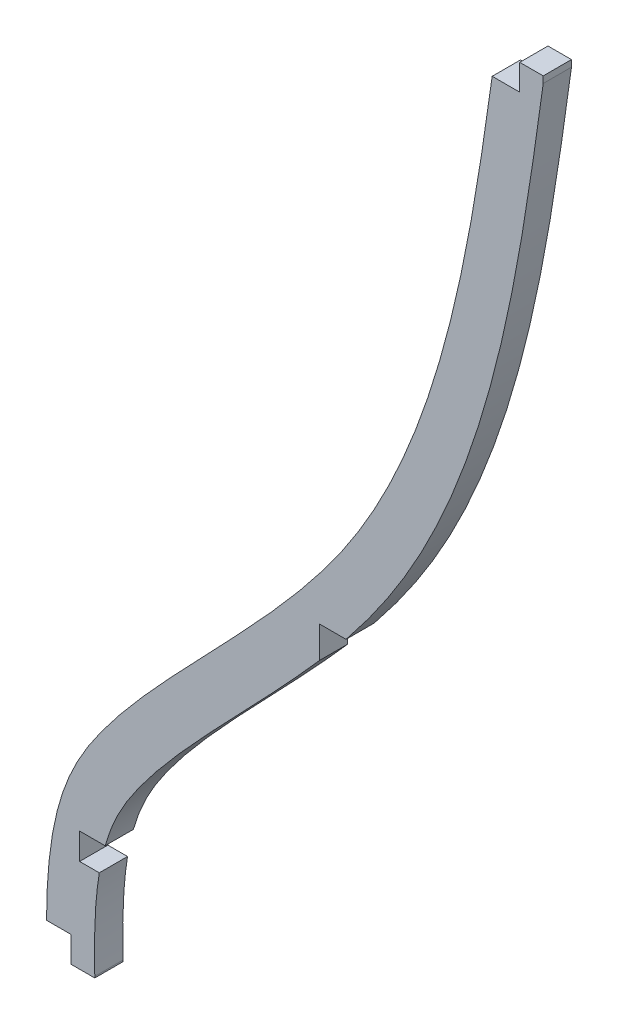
ISO-10303-21;
HEADER;
FILE_DESCRIPTION(('STEP AP214'),'2;1');
FILE_NAME('part.step','',(''),(''),'','','');
FILE_SCHEMA(('AUTOMOTIVE_DESIGN { 1 0 10303 214 1 1 1 1 }'));
ENDSEC;
DATA;
#1=APPLICATION_CONTEXT('core data for automotive mechanical design processes');
#2=APPLICATION_PROTOCOL_DEFINITION('international standard','automotive_design',2000,#1);
#3=PRODUCT_CONTEXT('',#1,'mechanical');
#4=PRODUCT('Part','Part','',(#3));
#5=PRODUCT_RELATED_PRODUCT_CATEGORY('part','',(#4));
#6=PRODUCT_DEFINITION_FORMATION('','',#4);
#7=PRODUCT_DEFINITION_CONTEXT('part definition',#1,'design');
#8=PRODUCT_DEFINITION('design','',#6,#7);
#9=PRODUCT_DEFINITION_SHAPE('','',#8);
#10=(LENGTH_UNIT() NAMED_UNIT(*) SI_UNIT(.MILLI.,.METRE.));
#11=(NAMED_UNIT(*) PLANE_ANGLE_UNIT() SI_UNIT($,.RADIAN.));
#12=(NAMED_UNIT(*) SI_UNIT($,.STERADIAN.) SOLID_ANGLE_UNIT());
#13=UNCERTAINTY_MEASURE_WITH_UNIT(LENGTH_MEASURE(1.E-05),#10,'distance_accuracy_value','');
#14=(GEOMETRIC_REPRESENTATION_CONTEXT(3) GLOBAL_UNCERTAINTY_ASSIGNED_CONTEXT((#13)) GLOBAL_UNIT_ASSIGNED_CONTEXT((#10,
#11,#12)) REPRESENTATION_CONTEXT('',''));
#15=CARTESIAN_POINT('',(0.,0.,0.));
#16=DIRECTION('',(0.,0.,1.));
#17=DIRECTION('',(1.,0.,0.));
#18=AXIS2_PLACEMENT_3D('',#15,#16,#17);
#19=CARTESIAN_POINT('',(-71.12228275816,0.152274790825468,2.9972));
#20=CARTESIAN_POINT('',(-71.1360709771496,0.612053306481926,2.9972));
#21=CARTESIAN_POINT('',(-71.1567058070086,1.54979316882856,2.9972));
#22=CARTESIAN_POINT('',(-71.1645984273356,3.28211812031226,2.9972));
#23=CARTESIAN_POINT('',(-71.1167972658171,5.2861742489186,2.9972));
#24=CARTESIAN_POINT('',(-70.9730711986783,7.42161548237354,2.9972));
#25=CARTESIAN_POINT('',(-70.6767068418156,9.95097976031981,2.9972));
#26=CARTESIAN_POINT('',(-70.1305550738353,12.5718264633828,2.9972));
#27=CARTESIAN_POINT('',(-69.2453812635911,15.104636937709,2.9972));
#28=CARTESIAN_POINT('',(-68.1202374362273,17.3343932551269,2.9972));
#29=CARTESIAN_POINT('',(-66.672184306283,19.5510756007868,2.9972));
#30=CARTESIAN_POINT('',(-64.8630643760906,21.9349302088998,2.9972));
#31=CARTESIAN_POINT('',(-62.1184326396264,25.2082421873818,2.9972));
#32=CARTESIAN_POINT('',(-58.1371910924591,29.5028468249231,2.9972));
#33=CARTESIAN_POINT('',(-52.8597313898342,34.9642275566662,2.9972));
#34=CARTESIAN_POINT('',(-47.4482093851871,40.7915416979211,2.9972));
#35=CARTESIAN_POINT('',(-42.2515146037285,47.0604507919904,2.9972));
#36=CARTESIAN_POINT('',(-37.6918324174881,53.925317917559,2.9972));
#37=CARTESIAN_POINT('',(-34.0642333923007,61.0843459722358,2.9972));
#38=CARTESIAN_POINT('',(-31.169794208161,68.4657942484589,2.9972));
#39=CARTESIAN_POINT('',(-28.9001236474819,75.9824768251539,2.9972));
#40=CARTESIAN_POINT('',(-27.1227122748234,83.5631378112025,2.9972));
#41=CARTESIAN_POINT('',(-25.7154204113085,91.1411224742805,2.9972));
#42=CARTESIAN_POINT('',(-24.7522109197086,97.3940158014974,2.9972));
#43=CARTESIAN_POINT('',(-24.0485885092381,102.335722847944,2.9972));
#44=CARTESIAN_POINT('',(-23.7122461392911,104.762949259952,2.9972));
#45=CARTESIAN_POINT('',(-23.5431598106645,105.98215738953,2.9972));
#46=B_SPLINE_CURVE_WITH_KNOTS('',3,(#19,#20,#21,#22,#23,#24,#25,#26,#27,#28,#29,#30,#31,#32,#33,
#34,#35,#36,#37,#38,#39,#40,#41,#42,#43,#44,#45),.UNSPECIFIED.,.F.,.F.,(4,1,1,1,1,1,1,1,1,1,1,1,
1,1,1,1,1,1,1,1,1,1,1,1,4),(0.,0.0078125,0.015625,0.03125,0.046875,0.0625,0.09375,0.125,0.15625,
0.1875,0.21875,0.25,0.3125,0.375,0.4375,0.5,0.5625,0.625,0.6875,0.75,0.8125,0.875,0.9375,
0.96875,1.),.UNSPECIFIED.);
#47=DIRECTION('',(0.,0.,-1.));
#48=VECTOR('',#47,1.);
#49=SURFACE_OF_LINEAR_EXTRUSION('',#46,#48);
#50=CARTESIAN_POINT('',(-71.12228275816,0.152274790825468,0.));
#51=CARTESIAN_POINT('',(-71.1360709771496,0.612053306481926,0.));
#52=CARTESIAN_POINT('',(-71.1567058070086,1.54979316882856,0.));
#53=CARTESIAN_POINT('',(-71.1645984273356,3.28211812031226,0.));
#54=CARTESIAN_POINT('',(-71.1167972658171,5.2861742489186,0.));
#55=CARTESIAN_POINT('',(-70.9730711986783,7.42161548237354,0.));
#56=CARTESIAN_POINT('',(-70.6767068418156,9.95097976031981,0.));
#57=CARTESIAN_POINT('',(-70.1305550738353,12.5718264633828,0.));
#58=CARTESIAN_POINT('',(-69.2453812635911,15.104636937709,0.));
#59=CARTESIAN_POINT('',(-68.1202374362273,17.3343932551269,0.));
#60=CARTESIAN_POINT('',(-66.672184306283,19.5510756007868,0.));
#61=CARTESIAN_POINT('',(-64.8630643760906,21.9349302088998,0.));
#62=CARTESIAN_POINT('',(-62.1184326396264,25.2082421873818,0.));
#63=CARTESIAN_POINT('',(-58.1371910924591,29.5028468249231,0.));
#64=CARTESIAN_POINT('',(-52.8597313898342,34.9642275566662,0.));
#65=CARTESIAN_POINT('',(-47.4482093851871,40.7915416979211,0.));
#66=CARTESIAN_POINT('',(-42.2515146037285,47.0604507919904,0.));
#67=CARTESIAN_POINT('',(-37.6918324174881,53.925317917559,0.));
#68=CARTESIAN_POINT('',(-34.0642333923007,61.0843459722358,0.));
#69=CARTESIAN_POINT('',(-31.169794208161,68.4657942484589,0.));
#70=CARTESIAN_POINT('',(-28.9001236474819,75.9824768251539,0.));
#71=CARTESIAN_POINT('',(-27.1227122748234,83.5631378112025,0.));
#72=CARTESIAN_POINT('',(-25.7154204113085,91.1411224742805,0.));
#73=CARTESIAN_POINT('',(-24.7522109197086,97.3940158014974,0.));
#74=CARTESIAN_POINT('',(-24.0485885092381,102.335722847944,0.));
#75=CARTESIAN_POINT('',(-23.7122461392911,104.762949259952,0.));
#76=CARTESIAN_POINT('',(-23.5431598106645,105.98215738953,0.));
#77=B_SPLINE_CURVE_WITH_KNOTS('',3,(#50,#51,#52,#53,#54,#55,#56,#57,#58,#59,#60,#61,#62,#63,#64,
#65,#66,#67,#68,#69,#70,#71,#72,#73,#74,#75,#76),.UNSPECIFIED.,.F.,.F.,(4,1,1,1,1,1,1,1,1,1,1,1,
1,1,1,1,1,1,1,1,1,1,1,1,4),(0.,0.0078125,0.015625,0.03125,0.046875,0.0625,0.09375,0.125,0.15625,
0.1875,0.21875,0.25,0.3125,0.375,0.4375,0.5,0.5625,0.625,0.6875,0.75,0.8125,0.875,0.9375,
0.96875,1.),.UNSPECIFIED.);
#78=CARTESIAN_POINT('',(-70.0284766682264,12.7,0.));
#79=VERTEX_POINT('',#78);
#80=CARTESIAN_POINT('',(-47.2876316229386,41.0895462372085,0.));
#81=VERTEX_POINT('',#80);
#82=EDGE_CURVE('E197',#79,#81,#77,.T.);
#83=ORIENTED_EDGE('',*,*,#82,.T.);
#84=DIRECTION('',(0.,0.,1.));
#85=VECTOR('',#84,1.);
#86=CARTESIAN_POINT('',(-47.2876316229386,41.0895462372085,0.));
#87=LINE('',#86,#85);
#88=CARTESIAN_POINT('',(-47.2876316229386,41.0895462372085,2.9972));
#89=VERTEX_POINT('',#88);
#90=EDGE_CURVE('E242',#81,#89,#87,.T.);
#91=ORIENTED_EDGE('',*,*,#90,.T.);
#92=CARTESIAN_POINT('',(-70.0284766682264,12.7,2.9972));
#93=VERTEX_POINT('',#92);
#94=EDGE_CURVE('E279',#93,#89,#46,.T.);
#95=ORIENTED_EDGE('',*,*,#94,.F.);
#96=DIRECTION('',(0.,0.,1.));
#97=VECTOR('',#96,1.);
#98=CARTESIAN_POINT('',(-70.0284766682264,12.7,0.));
#99=LINE('',#98,#97);
#100=EDGE_CURVE('E230',#79,#93,#99,.T.);
#101=ORIENTED_EDGE('',*,*,#100,.F.);
#102=EDGE_LOOP('',(#83,#91,#95,#101));
#103=FACE_BOUND('',#102,.T.);
#104=ADVANCED_FACE('F32',(#103),#49,.F.);
#105=CARTESIAN_POINT('',(-71.12228275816,0.152274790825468,0.));
#106=VERTEX_POINT('',#105);
#107=CARTESIAN_POINT('',(-70.6430311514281,9.90599999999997,0.));
#108=VERTEX_POINT('',#107);
#109=EDGE_CURVE('E191',#106,#108,#77,.T.);
#110=ORIENTED_EDGE('',*,*,#109,.T.);
#111=DIRECTION('',(0.,0.,1.));
#112=VECTOR('',#111,1.);
#113=CARTESIAN_POINT('',(-70.6430311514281,9.90599999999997,0.));
#114=LINE('',#113,#112);
#115=CARTESIAN_POINT('',(-70.6430311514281,9.90599999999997,2.9972));
#116=VERTEX_POINT('',#115);
#117=EDGE_CURVE('E247',#108,#116,#114,.T.);
#118=ORIENTED_EDGE('',*,*,#117,.T.);
#119=CARTESIAN_POINT('',(-71.12228275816,0.152274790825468,2.9972));
#120=VERTEX_POINT('',#119);
#121=EDGE_CURVE('E218',#120,#116,#46,.T.);
#122=ORIENTED_EDGE('',*,*,#121,.F.);
#123=DIRECTION('',(0.,0.,-1.));
#124=VECTOR('',#123,1.);
#125=CARTESIAN_POINT('',(-71.12228275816,0.152274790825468,2.9972));
#126=LINE('',#125,#124);
#127=EDGE_CURVE('E41',#120,#106,#126,.T.);
#128=ORIENTED_EDGE('',*,*,#127,.T.);
#129=EDGE_LOOP('',(#110,#118,#122,#128));
#130=FACE_BOUND('',#129,.T.);
#131=ADVANCED_FACE('F215',(#130),#49,.F.);
#132=CARTESIAN_POINT('',(-28.575,106.68,2.9972));
#133=CARTESIAN_POINT('',(-31.1223322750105,88.3122925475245,2.9972));
#134=CARTESIAN_POINT('',(-35.6949869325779,54.9592886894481,2.9972));
#135=CARTESIAN_POINT('',(-70.4253531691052,26.7634785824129,2.9972));
#136=CARTESIAN_POINT('',(-76.5696549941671,12.326423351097,2.9972));
#137=CARTESIAN_POINT('',(-76.2,0.,2.9972));
#138=B_SPLINE_CURVE_WITH_KNOTS('',3,(#132,#133,#134,#135,#136,#137),.UNSPECIFIED.,.F.,.F.,(4,1,
1,4),(0.,0.473853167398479,0.807071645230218,1.),.UNSPECIFIED.);
#139=DIRECTION('',(0.,0.,-1.));
#140=VECTOR('',#139,1.);
#141=SURFACE_OF_LINEAR_EXTRUSION('',#138,#140);
#142=CARTESIAN_POINT('',(-28.9562663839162,103.9368,2.9972));
#143=VERTEX_POINT('',#142);
#144=CARTESIAN_POINT('',(-76.239147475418,2.74319999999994,2.9972));
#145=VERTEX_POINT('',#144);
#146=EDGE_CURVE('E167',#143,#145,#138,.T.);
#147=ORIENTED_EDGE('',*,*,#146,.F.);
#148=DIRECTION('',(0.,0.,1.));
#149=VECTOR('',#148,1.);
#150=CARTESIAN_POINT('',(-28.9562663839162,103.9368,0.));
#151=LINE('',#150,#149);
#152=CARTESIAN_POINT('',(-28.9562663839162,103.9368,0.));
#153=VERTEX_POINT('',#152);
#154=EDGE_CURVE('E155',#153,#143,#151,.T.);
#155=ORIENTED_EDGE('',*,*,#154,.F.);
#156=CARTESIAN_POINT('',(-28.575,106.68,0.));
#157=CARTESIAN_POINT('',(-31.1223322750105,88.3122925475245,0.));
#158=CARTESIAN_POINT('',(-35.6949869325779,54.9592886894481,0.));
#159=CARTESIAN_POINT('',(-70.4253531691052,26.7634785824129,0.));
#160=CARTESIAN_POINT('',(-76.5696549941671,12.326423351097,0.));
#161=CARTESIAN_POINT('',(-76.2,0.,0.));
#162=B_SPLINE_CURVE_WITH_KNOTS('',3,(#156,#157,#158,#159,#160,#161),.UNSPECIFIED.,.F.,.F.,(4,1,
1,4),(0.,0.473853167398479,0.807071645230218,1.),.UNSPECIFIED.);
#163=CARTESIAN_POINT('',(-76.239147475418,2.74319999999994,0.));
#164=VERTEX_POINT('',#163);
#165=EDGE_CURVE('E165',#153,#164,#162,.T.);
#166=ORIENTED_EDGE('',*,*,#165,.T.);
#167=DIRECTION('',(0.,0.,1.));
#168=VECTOR('',#167,1.);
#169=CARTESIAN_POINT('',(-76.239147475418,2.74319999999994,0.));
#170=LINE('',#169,#168);
#171=EDGE_CURVE('E174',#164,#145,#170,.T.);
#172=ORIENTED_EDGE('',*,*,#171,.T.);
#173=EDGE_LOOP('',(#147,#155,#166,#172));
#174=FACE_BOUND('',#173,.T.);
#175=ADVANCED_FACE('F34',(#174),#141,.F.);
#176=CARTESIAN_POINT('',(-71.1222823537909,0.,2.9972));
#177=DIRECTION('',(0.,1.,0.));
#178=DIRECTION('',(-1.,0.,0.));
#179=AXIS2_PLACEMENT_3D('',#176,#177,#178);
#180=PLANE('',#179);
#181=DIRECTION('',(1.,0.,0.));
#182=VECTOR('',#181,1.);
#183=CARTESIAN_POINT('',(-71.1222823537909,0.,2.9972));
#184=LINE('',#183,#182);
#185=CARTESIAN_POINT('',(-73.66,0.,2.9972));
#186=VERTEX_POINT('',#185);
#187=CARTESIAN_POINT('',(-71.1222823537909,0.,2.9972));
#188=VERTEX_POINT('',#187);
#189=EDGE_CURVE('E267',#186,#188,#184,.T.);
#190=ORIENTED_EDGE('',*,*,#189,.F.);
#191=DIRECTION('',(0.,0.,1.));
#192=VECTOR('',#191,1.);
#193=CARTESIAN_POINT('',(-73.66,0.,0.));
#194=LINE('',#193,#192);
#195=CARTESIAN_POINT('',(-73.66,0.,0.));
#196=VERTEX_POINT('',#195);
#197=EDGE_CURVE('E257',#196,#186,#194,.T.);
#198=ORIENTED_EDGE('',*,*,#197,.F.);
#199=DIRECTION('',(1.,0.,0.));
#200=VECTOR('',#199,1.);
#201=CARTESIAN_POINT('',(-71.1222823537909,0.,0.));
#202=LINE('',#201,#200);
#203=CARTESIAN_POINT('',(-71.1222823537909,0.,0.));
#204=VERTEX_POINT('',#203);
#205=EDGE_CURVE('E173',#196,#204,#202,.T.);
#206=ORIENTED_EDGE('',*,*,#205,.T.);
#207=DIRECTION('',(0.,0.,-1.));
#208=VECTOR('',#207,1.);
#209=CARTESIAN_POINT('',(-71.1222823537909,0.,2.9972));
#210=LINE('',#209,#208);
#211=EDGE_CURVE('E11',#188,#204,#210,.T.);
#212=ORIENTED_EDGE('',*,*,#211,.F.);
#213=EDGE_LOOP('',(#190,#198,#206,#212));
#214=FACE_BOUND('',#213,.T.);
#215=ADVANCED_FACE('F293',(#214),#180,.F.);
#216=CARTESIAN_POINT('',(-71.12228275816,0.152274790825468,2.9972));
#217=DIRECTION('',(-0.999999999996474,-2.65552242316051E-06,0.));
#218=DIRECTION('',(2.65552242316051E-06,-0.999999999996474,0.));
#219=AXIS2_PLACEMENT_3D('',#216,#217,#218);
#220=PLANE('',#219);
#221=DIRECTION('',(-2.65552242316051E-06,0.999999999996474,0.));
#222=VECTOR('',#221,1.);
#223=CARTESIAN_POINT('',(-71.12228275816,0.152274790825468,0.));
#224=LINE('',#223,#222);
#225=EDGE_CURVE('E176',#204,#106,#224,.T.);
#226=ORIENTED_EDGE('',*,*,#225,.T.);
#227=ORIENTED_EDGE('',*,*,#127,.F.);
#228=DIRECTION('',(-2.65552242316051E-06,0.999999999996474,0.));
#229=VECTOR('',#228,1.);
#230=CARTESIAN_POINT('',(-71.12228275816,0.152274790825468,2.9972));
#231=LINE('',#230,#229);
#232=EDGE_CURVE('E272',#188,#120,#231,.T.);
#233=ORIENTED_EDGE('',*,*,#232,.F.);
#234=ORIENTED_EDGE('',*,*,#211,.T.);
#235=EDGE_LOOP('',(#226,#227,#233,#234));
#236=FACE_BOUND('',#235,.T.);
#237=ADVANCED_FACE('F289',(#236),#220,.F.);
#238=CARTESIAN_POINT('',(-44.459383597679,44.45,2.9972));
#239=VERTEX_POINT('',#238);
#240=CARTESIAN_POINT('',(-23.5431598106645,105.98215738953,2.9972));
#241=VERTEX_POINT('',#240);
#242=EDGE_CURVE('E274',#239,#241,#46,.T.);
#243=ORIENTED_EDGE('',*,*,#242,.F.);
#244=DIRECTION('',(0.,0.,1.));
#245=VECTOR('',#244,1.);
#246=CARTESIAN_POINT('',(-44.459383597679,44.45,0.));
#247=LINE('',#246,#245);
#248=CARTESIAN_POINT('',(-44.459383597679,44.45,0.));
#249=VERTEX_POINT('',#248);
#250=EDGE_CURVE('E316',#249,#239,#247,.T.);
#251=ORIENTED_EDGE('',*,*,#250,.F.);
#252=CARTESIAN_POINT('',(-23.5431598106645,105.98215738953,0.));
#253=VERTEX_POINT('',#252);
#254=EDGE_CURVE('E190',#249,#253,#77,.T.);
#255=ORIENTED_EDGE('',*,*,#254,.T.);
#256=DIRECTION('',(0.,0.,-1.));
#257=VECTOR('',#256,1.);
#258=CARTESIAN_POINT('',(-23.5431598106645,105.98215738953,2.9972));
#259=LINE('',#258,#257);
#260=EDGE_CURVE('E208',#241,#253,#259,.T.);
#261=ORIENTED_EDGE('',*,*,#260,.F.);
#262=EDGE_LOOP('',(#243,#251,#255,#261));
#263=FACE_BOUND('',#262,.T.);
#264=ADVANCED_FACE('F284',(#263),#49,.F.);
#265=CARTESIAN_POINT('',(-23.5431598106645,105.98215738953,2.9972));
#266=DIRECTION('',(-1.,0.,0.));
#267=DIRECTION('',(0.,0.,1.));
#268=AXIS2_PLACEMENT_3D('',#265,#266,#267);
#269=PLANE('',#268);
#270=DIRECTION('',(0.,1.,0.));
#271=VECTOR('',#270,1.);
#272=CARTESIAN_POINT('',(-23.5431598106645,105.98215738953,0.));
#273=LINE('',#272,#271);
#274=CARTESIAN_POINT('',(-23.5431598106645,106.68,0.));
#275=VERTEX_POINT('',#274);
#276=EDGE_CURVE('E196',#253,#275,#273,.T.);
#277=ORIENTED_EDGE('',*,*,#276,.T.);
#278=DIRECTION('',(0.,0.,-1.));
#279=VECTOR('',#278,1.);
#280=CARTESIAN_POINT('',(-23.5431598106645,106.68,2.9972));
#281=LINE('',#280,#279);
#282=CARTESIAN_POINT('',(-23.5431598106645,106.68,2.9972));
#283=VERTEX_POINT('',#282);
#284=EDGE_CURVE('E205',#283,#275,#281,.T.);
#285=ORIENTED_EDGE('',*,*,#284,.F.);
#286=DIRECTION('',(0.,1.,0.));
#287=VECTOR('',#286,1.);
#288=CARTESIAN_POINT('',(-23.5431598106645,105.98215738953,2.9972));
#289=LINE('',#288,#287);
#290=EDGE_CURVE('E278',#241,#283,#289,.T.);
#291=ORIENTED_EDGE('',*,*,#290,.F.);
#292=ORIENTED_EDGE('',*,*,#260,.T.);
#293=EDGE_LOOP('',(#277,#285,#291,#292));
#294=FACE_BOUND('',#293,.T.);
#295=ADVANCED_FACE('F288',(#294),#269,.F.);
#296=CARTESIAN_POINT('',(-28.575,106.68,2.9972));
#297=DIRECTION('',(0.,-1.,0.));
#298=DIRECTION('',(0.,0.,-1.));
#299=AXIS2_PLACEMENT_3D('',#296,#297,#298);
#300=PLANE('',#299);
#301=DIRECTION('',(-1.,0.,0.));
#302=VECTOR('',#301,1.);
#303=CARTESIAN_POINT('',(-28.575,106.68,0.));
#304=LINE('',#303,#302);
#305=CARTESIAN_POINT('',(-26.035,106.68,0.));
#306=VERTEX_POINT('',#305);
#307=EDGE_CURVE('E202',#275,#306,#304,.T.);
#308=ORIENTED_EDGE('',*,*,#307,.T.);
#309=DIRECTION('',(0.,0.,1.));
#310=VECTOR('',#309,1.);
#311=CARTESIAN_POINT('',(-26.035,106.68,0.));
#312=LINE('',#311,#310);
#313=CARTESIAN_POINT('',(-26.035,106.68,2.9972));
#314=VERTEX_POINT('',#313);
#315=EDGE_CURVE('E326',#306,#314,#312,.T.);
#316=ORIENTED_EDGE('',*,*,#315,.T.);
#317=DIRECTION('',(-1.,0.,0.));
#318=VECTOR('',#317,1.);
#319=CARTESIAN_POINT('',(-28.575,106.68,2.9972));
#320=LINE('',#319,#318);
#321=EDGE_CURVE('E183',#283,#314,#320,.T.);
#322=ORIENTED_EDGE('',*,*,#321,.F.);
#323=ORIENTED_EDGE('',*,*,#284,.T.);
#324=EDGE_LOOP('',(#308,#316,#322,#323));
#325=FACE_BOUND('',#324,.T.);
#326=ADVANCED_FACE('F324',(#325),#300,.F.);
#327=CARTESIAN_POINT('',(-46.430466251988,50.1960313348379,2.9972));
#328=DIRECTION('',(0.,0.,1.));
#329=DIRECTION('',(1.,0.,0.));
#330=AXIS2_PLACEMENT_3D('',#327,#328,#329);
#331=PLANE('',#330);
#332=DIRECTION('',(0.,1.,0.));
#333=VECTOR('',#332,1.);
#334=CARTESIAN_POINT('',(-26.035,106.68,2.9972));
#335=LINE('',#334,#333);
#336=CARTESIAN_POINT('',(-26.035,103.9368,2.9972));
#337=VERTEX_POINT('',#336);
#338=EDGE_CURVE('E160',#337,#314,#335,.T.);
#339=ORIENTED_EDGE('',*,*,#338,.F.);
#340=DIRECTION('',(1.,0.,0.));
#341=VECTOR('',#340,1.);
#342=CARTESIAN_POINT('',(-26.035,103.9368,2.9972));
#343=LINE('',#342,#341);
#344=EDGE_CURVE('E355',#143,#337,#343,.T.);
#345=ORIENTED_EDGE('',*,*,#344,.F.);
#346=ORIENTED_EDGE('',*,*,#146,.T.);
#347=DIRECTION('',(-1.,0.,0.));
#348=VECTOR('',#347,1.);
#349=CARTESIAN_POINT('',(-73.66,2.7432,2.9972));
#350=LINE('',#349,#348);
#351=CARTESIAN_POINT('',(-73.66,2.7432,2.9972));
#352=VERTEX_POINT('',#351);
#353=EDGE_CURVE('E255',#352,#145,#350,.T.);
#354=ORIENTED_EDGE('',*,*,#353,.F.);
#355=DIRECTION('',(0.,1.,0.));
#356=VECTOR('',#355,1.);
#357=CARTESIAN_POINT('',(-73.66,0.,2.9972));
#358=LINE('',#357,#356);
#359=EDGE_CURVE('E249',#186,#352,#358,.T.);
#360=ORIENTED_EDGE('',*,*,#359,.F.);
#361=ORIENTED_EDGE('',*,*,#189,.T.);
#362=ORIENTED_EDGE('',*,*,#232,.T.);
#363=ORIENTED_EDGE('',*,*,#121,.T.);
#364=DIRECTION('',(1.,0.,0.));
#365=VECTOR('',#364,1.);
#366=CARTESIAN_POINT('',(-72.7299662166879,9.906,2.9972));
#367=LINE('',#366,#365);
#368=CARTESIAN_POINT('',(-72.7299662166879,9.906,2.9972));
#369=VERTEX_POINT('',#368);
#370=EDGE_CURVE('E245',#369,#116,#367,.T.);
#371=ORIENTED_EDGE('',*,*,#370,.F.);
#372=DIRECTION('',(0.,-1.,0.));
#373=VECTOR('',#372,1.);
#374=CARTESIAN_POINT('',(-72.7299662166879,12.7,2.9972));
#375=LINE('',#374,#373);
#376=CARTESIAN_POINT('',(-72.7299662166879,12.7,2.9972));
#377=VERTEX_POINT('',#376);
#378=EDGE_CURVE('E241',#377,#369,#375,.T.);
#379=ORIENTED_EDGE('',*,*,#378,.F.);
#380=DIRECTION('',(-1.,0.,0.));
#381=VECTOR('',#380,1.);
#382=CARTESIAN_POINT('',(-70.0284766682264,12.7,2.9972));
#383=LINE('',#382,#381);
#384=EDGE_CURVE('E238',#93,#377,#383,.T.);
#385=ORIENTED_EDGE('',*,*,#384,.F.);
#386=ORIENTED_EDGE('',*,*,#94,.T.);
#387=DIRECTION('',(0.,-1.,0.));
#388=VECTOR('',#387,1.);
#389=CARTESIAN_POINT('',(-47.2876316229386,44.45,2.9972));
#390=LINE('',#389,#388);
#391=CARTESIAN_POINT('',(-47.2876316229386,44.45,2.9972));
#392=VERTEX_POINT('',#391);
#393=EDGE_CURVE('E336',#392,#89,#390,.T.);
#394=ORIENTED_EDGE('',*,*,#393,.F.);
#395=DIRECTION('',(-1.,0.,0.));
#396=VECTOR('',#395,1.);
#397=CARTESIAN_POINT('',(-44.459383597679,44.45,2.9972));
#398=LINE('',#397,#396);
#399=EDGE_CURVE('E334',#239,#392,#398,.T.);
#400=ORIENTED_EDGE('',*,*,#399,.F.);
#401=ORIENTED_EDGE('',*,*,#242,.T.);
#402=ORIENTED_EDGE('',*,*,#290,.T.);
#403=ORIENTED_EDGE('',*,*,#321,.T.);
#404=EDGE_LOOP('',(#339,#345,#346,#354,#360,#361,#362,#363,#371,#379,#385,#386,#394,#400,#401,
#402,#403));
#405=FACE_BOUND('',#404,.T.);
#406=ADVANCED_FACE('F330',(#405),#331,.T.);
#407=CARTESIAN_POINT('',(-46.430466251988,50.1960313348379,0.));
#408=DIRECTION('',(0.,0.,1.));
#409=DIRECTION('',(1.,0.,0.));
#410=AXIS2_PLACEMENT_3D('',#407,#408,#409);
#411=PLANE('',#410);
#412=DIRECTION('',(1.,0.,0.));
#413=VECTOR('',#412,1.);
#414=CARTESIAN_POINT('',(-26.035,103.9368,0.));
#415=LINE('',#414,#413);
#416=CARTESIAN_POINT('',(-26.035,103.9368,0.));
#417=VERTEX_POINT('',#416);
#418=EDGE_CURVE('E151',#153,#417,#415,.T.);
#419=ORIENTED_EDGE('',*,*,#418,.T.);
#420=DIRECTION('',(0.,1.,0.));
#421=VECTOR('',#420,1.);
#422=CARTESIAN_POINT('',(-26.035,106.68,0.));
#423=LINE('',#422,#421);
#424=EDGE_CURVE('E48',#417,#306,#423,.T.);
#425=ORIENTED_EDGE('',*,*,#424,.T.);
#426=ORIENTED_EDGE('',*,*,#307,.F.);
#427=ORIENTED_EDGE('',*,*,#276,.F.);
#428=ORIENTED_EDGE('',*,*,#254,.F.);
#429=DIRECTION('',(-1.,0.,0.));
#430=VECTOR('',#429,1.);
#431=CARTESIAN_POINT('',(-44.459383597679,44.45,0.));
#432=LINE('',#431,#430);
#433=CARTESIAN_POINT('',(-47.2876316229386,44.45,0.));
#434=VERTEX_POINT('',#433);
#435=EDGE_CURVE('E348',#249,#434,#432,.T.);
#436=ORIENTED_EDGE('',*,*,#435,.T.);
#437=DIRECTION('',(0.,-1.,0.));
#438=VECTOR('',#437,1.);
#439=CARTESIAN_POINT('',(-47.2876316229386,44.45,0.));
#440=LINE('',#439,#438);
#441=EDGE_CURVE('E56',#434,#81,#440,.T.);
#442=ORIENTED_EDGE('',*,*,#441,.T.);
#443=ORIENTED_EDGE('',*,*,#82,.F.);
#444=DIRECTION('',(-1.,0.,0.));
#445=VECTOR('',#444,1.);
#446=CARTESIAN_POINT('',(-70.0284766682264,12.7,0.));
#447=LINE('',#446,#445);
#448=CARTESIAN_POINT('',(-72.7299662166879,12.7,0.));
#449=VERTEX_POINT('',#448);
#450=EDGE_CURVE('E234',#79,#449,#447,.T.);
#451=ORIENTED_EDGE('',*,*,#450,.T.);
#452=DIRECTION('',(0.,-1.,0.));
#453=VECTOR('',#452,1.);
#454=CARTESIAN_POINT('',(-72.7299662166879,12.7,0.));
#455=LINE('',#454,#453);
#456=CARTESIAN_POINT('',(-72.7299662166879,9.906,0.));
#457=VERTEX_POINT('',#456);
#458=EDGE_CURVE('E228',#449,#457,#455,.T.);
#459=ORIENTED_EDGE('',*,*,#458,.T.);
#460=DIRECTION('',(1.,0.,0.));
#461=VECTOR('',#460,1.);
#462=CARTESIAN_POINT('',(-72.7299662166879,9.906,0.));
#463=LINE('',#462,#461);
#464=EDGE_CURVE('E226',#457,#108,#463,.T.);
#465=ORIENTED_EDGE('',*,*,#464,.T.);
#466=ORIENTED_EDGE('',*,*,#109,.F.);
#467=ORIENTED_EDGE('',*,*,#225,.F.);
#468=ORIENTED_EDGE('',*,*,#205,.F.);
#469=DIRECTION('',(0.,1.,0.));
#470=VECTOR('',#469,1.);
#471=CARTESIAN_POINT('',(-73.66,0.,0.));
#472=LINE('',#471,#470);
#473=CARTESIAN_POINT('',(-73.66,2.7432,0.));
#474=VERTEX_POINT('',#473);
#475=EDGE_CURVE('E253',#196,#474,#472,.T.);
#476=ORIENTED_EDGE('',*,*,#475,.T.);
#477=DIRECTION('',(-1.,0.,0.));
#478=VECTOR('',#477,1.);
#479=CARTESIAN_POINT('',(-73.66,2.7432,0.));
#480=LINE('',#479,#478);
#481=EDGE_CURVE('E172',#474,#164,#480,.T.);
#482=ORIENTED_EDGE('',*,*,#481,.T.);
#483=ORIENTED_EDGE('',*,*,#165,.F.);
#484=EDGE_LOOP('',(#419,#425,#426,#427,#428,#436,#442,#443,#451,#459,#465,#466,#467,#468,#476,
#482,#483));
#485=FACE_BOUND('',#484,.T.);
#486=ADVANCED_FACE('F170',(#485),#411,.F.);
#487=CARTESIAN_POINT('',(-73.66,2.7432,0.));
#488=DIRECTION('',(0.,1.,0.));
#489=DIRECTION('',(-1.,0.,0.));
#490=AXIS2_PLACEMENT_3D('',#487,#488,#489);
#491=PLANE('',#490);
#492=ORIENTED_EDGE('',*,*,#353,.T.);
#493=ORIENTED_EDGE('',*,*,#171,.F.);
#494=ORIENTED_EDGE('',*,*,#481,.F.);
#495=DIRECTION('',(0.,0.,1.));
#496=VECTOR('',#495,1.);
#497=CARTESIAN_POINT('',(-73.66,2.7432,0.));
#498=LINE('',#497,#496);
#499=EDGE_CURVE('E178',#474,#352,#498,.T.);
#500=ORIENTED_EDGE('',*,*,#499,.T.);
#501=EDGE_LOOP('',(#492,#493,#494,#500));
#502=FACE_BOUND('',#501,.T.);
#503=ADVANCED_FACE('F382',(#502),#491,.F.);
#504=CARTESIAN_POINT('',(-73.66,0.,0.));
#505=DIRECTION('',(1.,0.,0.));
#506=DIRECTION('',(0.,0.,-1.));
#507=AXIS2_PLACEMENT_3D('',#504,#505,#506);
#508=PLANE('',#507);
#509=ORIENTED_EDGE('',*,*,#359,.T.);
#510=ORIENTED_EDGE('',*,*,#499,.F.);
#511=ORIENTED_EDGE('',*,*,#475,.F.);
#512=ORIENTED_EDGE('',*,*,#197,.T.);
#513=EDGE_LOOP('',(#509,#510,#511,#512));
#514=FACE_BOUND('',#513,.T.);
#515=ADVANCED_FACE('F376',(#514),#508,.F.);
#516=CARTESIAN_POINT('',(-72.7299662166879,9.906,0.));
#517=DIRECTION('',(0.,-1.,0.));
#518=DIRECTION('',(1.,0.,0.));
#519=AXIS2_PLACEMENT_3D('',#516,#517,#518);
#520=PLANE('',#519);
#521=ORIENTED_EDGE('',*,*,#370,.T.);
#522=ORIENTED_EDGE('',*,*,#117,.F.);
#523=ORIENTED_EDGE('',*,*,#464,.F.);
#524=DIRECTION('',(0.,0.,1.));
#525=VECTOR('',#524,1.);
#526=CARTESIAN_POINT('',(-72.7299662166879,9.906,0.));
#527=LINE('',#526,#525);
#528=EDGE_CURVE('E250',#457,#369,#527,.T.);
#529=ORIENTED_EDGE('',*,*,#528,.T.);
#530=EDGE_LOOP('',(#521,#522,#523,#529));
#531=FACE_BOUND('',#530,.T.);
#532=ADVANCED_FACE('F372',(#531),#520,.F.);
#533=CARTESIAN_POINT('',(-72.7299662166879,12.7,0.));
#534=DIRECTION('',(-1.,0.,0.));
#535=DIRECTION('',(0.,0.,1.));
#536=AXIS2_PLACEMENT_3D('',#533,#534,#535);
#537=PLANE('',#536);
#538=ORIENTED_EDGE('',*,*,#378,.T.);
#539=ORIENTED_EDGE('',*,*,#528,.F.);
#540=ORIENTED_EDGE('',*,*,#458,.F.);
#541=DIRECTION('',(0.,0.,1.));
#542=VECTOR('',#541,1.);
#543=CARTESIAN_POINT('',(-72.7299662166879,12.7,0.));
#544=LINE('',#543,#542);
#545=EDGE_CURVE('E232',#449,#377,#544,.T.);
#546=ORIENTED_EDGE('',*,*,#545,.T.);
#547=EDGE_LOOP('',(#538,#539,#540,#546));
#548=FACE_BOUND('',#547,.T.);
#549=ADVANCED_FACE('F375',(#548),#537,.F.);
#550=CARTESIAN_POINT('',(-70.0284766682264,12.7,0.));
#551=DIRECTION('',(0.,1.,0.));
#552=DIRECTION('',(0.,0.,1.));
#553=AXIS2_PLACEMENT_3D('',#550,#551,#552);
#554=PLANE('',#553);
#555=ORIENTED_EDGE('',*,*,#384,.T.);
#556=ORIENTED_EDGE('',*,*,#545,.F.);
#557=ORIENTED_EDGE('',*,*,#450,.F.);
#558=ORIENTED_EDGE('',*,*,#100,.T.);
#559=EDGE_LOOP('',(#555,#556,#557,#558));
#560=FACE_BOUND('',#559,.T.);
#561=ADVANCED_FACE('F341',(#560),#554,.F.);
#562=CARTESIAN_POINT('',(-47.2876316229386,44.45,0.));
#563=DIRECTION('',(-1.,0.,0.));
#564=DIRECTION('',(0.,-1.,0.));
#565=AXIS2_PLACEMENT_3D('',#562,#563,#564);
#566=PLANE('',#565);
#567=ORIENTED_EDGE('',*,*,#393,.T.);
#568=ORIENTED_EDGE('',*,*,#90,.F.);
#569=ORIENTED_EDGE('',*,*,#441,.F.);
#570=DIRECTION('',(0.,0.,1.));
#571=VECTOR('',#570,1.);
#572=CARTESIAN_POINT('',(-47.2876316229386,44.45,0.));
#573=LINE('',#572,#571);
#574=EDGE_CURVE('E344',#434,#392,#573,.T.);
#575=ORIENTED_EDGE('',*,*,#574,.T.);
#576=EDGE_LOOP('',(#567,#568,#569,#575));
#577=FACE_BOUND('',#576,.T.);
#578=ADVANCED_FACE('F366',(#577),#566,.F.);
#579=CARTESIAN_POINT('',(-44.459383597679,44.45,0.));
#580=DIRECTION('',(0.,1.,0.));
#581=DIRECTION('',(-1.,0.,0.));
#582=AXIS2_PLACEMENT_3D('',#579,#580,#581);
#583=PLANE('',#582);
#584=ORIENTED_EDGE('',*,*,#399,.T.);
#585=ORIENTED_EDGE('',*,*,#574,.F.);
#586=ORIENTED_EDGE('',*,*,#435,.F.);
#587=ORIENTED_EDGE('',*,*,#250,.T.);
#588=EDGE_LOOP('',(#584,#585,#586,#587));
#589=FACE_BOUND('',#588,.T.);
#590=ADVANCED_FACE('F359',(#589),#583,.F.);
#591=CARTESIAN_POINT('',(-26.035,106.68,0.));
#592=DIRECTION('',(1.,0.,0.));
#593=DIRECTION('',(0.,0.,-1.));
#594=AXIS2_PLACEMENT_3D('',#591,#592,#593);
#595=PLANE('',#594);
#596=ORIENTED_EDGE('',*,*,#338,.T.);
#597=ORIENTED_EDGE('',*,*,#315,.F.);
#598=ORIENTED_EDGE('',*,*,#424,.F.);
#599=DIRECTION('',(0.,0.,1.));
#600=VECTOR('',#599,1.);
#601=CARTESIAN_POINT('',(-26.035,103.9368,0.));
#602=LINE('',#601,#600);
#603=EDGE_CURVE('E157',#417,#337,#602,.T.);
#604=ORIENTED_EDGE('',*,*,#603,.T.);
#605=EDGE_LOOP('',(#596,#597,#598,#604));
#606=FACE_BOUND('',#605,.T.);
#607=ADVANCED_FACE('F357',(#606),#595,.F.);
#608=CARTESIAN_POINT('',(-26.035,103.9368,0.));
#609=DIRECTION('',(0.,-1.,0.));
#610=DIRECTION('',(0.,0.,-1.));
#611=AXIS2_PLACEMENT_3D('',#608,#609,#610);
#612=PLANE('',#611);
#613=ORIENTED_EDGE('',*,*,#344,.T.);
#614=ORIENTED_EDGE('',*,*,#603,.F.);
#615=ORIENTED_EDGE('',*,*,#418,.F.);
#616=ORIENTED_EDGE('',*,*,#154,.T.);
#617=EDGE_LOOP('',(#613,#614,#615,#616));
#618=FACE_BOUND('',#617,.T.);
#619=ADVANCED_FACE('F154',(#618),#612,.F.);
#620=CLOSED_SHELL('',(#104,#131,#175,#215,#237,#264,#295,#326,#406,#486,#503,#515,#532,#549,
#561,#578,#590,#607,#619));
#621=MANIFOLD_SOLID_BREP('B2',#620);
#622=ADVANCED_BREP_SHAPE_REPRESENTATION('',(#18,#621),#14);
#623=SHAPE_DEFINITION_REPRESENTATION(#9,#622);
ENDSEC;
END-ISO-10303-21;
